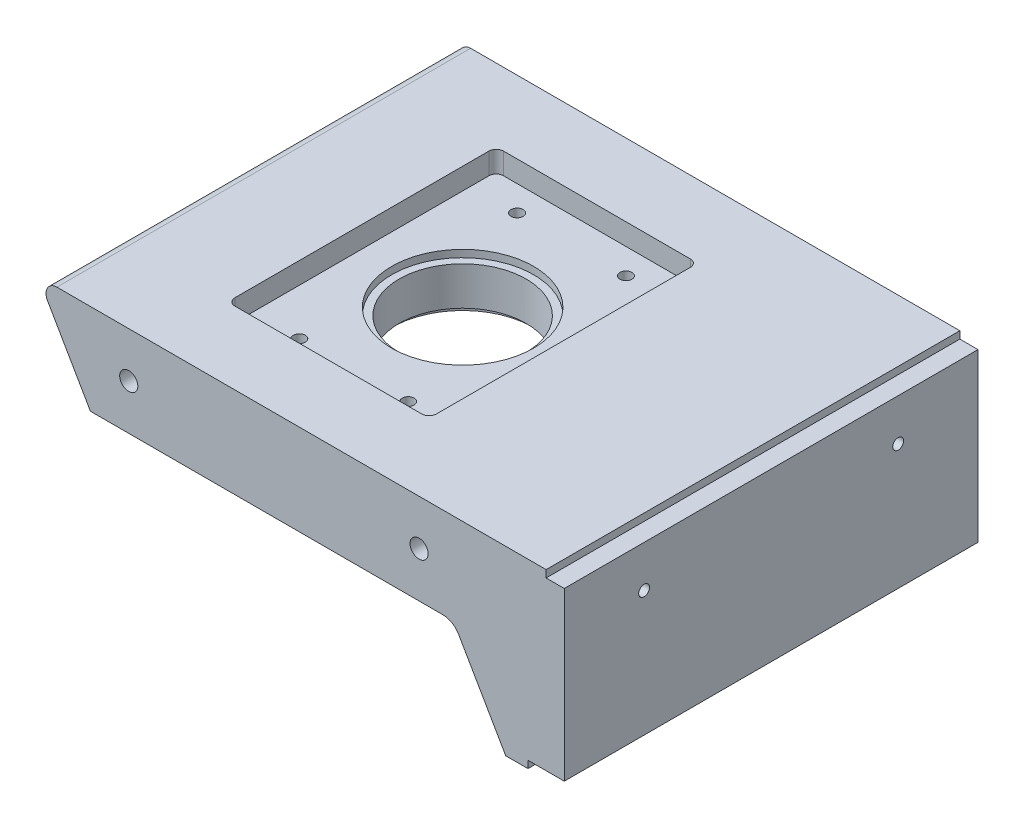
from build123d import *

# Parameters (mm, degrees)
BOSS_EXTRUDE1_DEPTH            = 57
SKETCH5_R                      = 17.5
CUT_EXTRUDE1_DEPTH             = 114.903467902
SKETCH11_W                     = 10
SKETCH11_H                     = 2
CUT_EXTRUDE3_DEPTH             = 148.062061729
M6X1_0_TAPPED_HOLE1_AT_2_COUNT = 2
M6X1_0_TAPPED_HOLE1_AT_2_PITCH = 80
M3X0_5_TAPPED_HOLE2_D          = 2.5
M3X0_5_TAPPED_HOLE2_DEPTH      = 7.5
M3X0_5_TAPPED_HOLE2_TIP        = 0.751075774
FILLET1_R                      = 3
FILLET2_R                      = 5
SKETCH28_W                     = 55.5
SKETCH28_H                     = 74
CUT_EXTRUDE6_DEPTH             = 5.9
SKETCH30_R                     = 19.55
CUT_EXTRUDE8_DEPTH             = 2
FILLET3_R                      = 2
M4X0_7_TAPPED_HOLE1_D          = 3.3
M4X0_7_TAPPED_HOLE1_DEPTH      = 11.5
M4X0_7_TAPPED_HOLE1_TIP        = 0.991420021
SKETCH35_W                     = 55.5
SKETCH35_H                     = 94
CUT_EXTRUDE11_DEPTH            = 4.5
FILLET6_R                      = 2
CUT_EXTRUDE12_START            = -2
SKETCH36_R                     = 19.55
CUT_EXTRUDE12_DEPTH            = 2
M4X0_7_TAPPED_HOLE3_D          = 3.3
M4X0_7_TAPPED_HOLE3_DEPTH      = 11.5
M4X0_7_TAPPED_HOLE3_TIP        = 0.991420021
F_3_0_3_DIAMETER_HOLE2_D       = 3
F_3_0_3_DIAMETER_HOLE2_DEPTH   = 10
F_3_0_3_DIAMETER_HOLE2_TIP     = 0.901290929


with BuildPart() as part:
    # Sketch2 → Boss-Extrude1 (new, symmetric)
    with BuildSketch(Plane.XY):
        Polygon((-60, 12.5), (80, 12.5), (80, 10.5), (85, 10.5), (85, -37.5), (68.87, -37.5), (54.43624327, -12.5), (-45.56624327, -12.5), align=None)
    extrude(amount=BOSS_EXTRUDE1_DEPTH, both=True)

    # Sketch5 → Cut-Extrude1 (cut, through all)
    with BuildSketch(Plane(origin=(0, 12.5, 0), x_dir=(1, 0, 0), z_dir=(0, 1, 0))):
        with Locations(Location((0, 0, 0), (0, 0, 180))):
            Circle(SKETCH5_R)
    extrude(amount=-CUT_EXTRUDE1_DEPTH, mode=Mode.SUBTRACT)

    # Sketch11 → Cut-Extrude3 (cut, through all)
    with BuildSketch(Plane.XY.offset(57)):
        with Locations((80, -36.5)):
            Rectangle(SKETCH11_W, SKETCH11_H)
    extrude(amount=-CUT_EXTRUDE3_DEPTH, mode=Mode.SUBTRACT)

    # Sketch12 → M6x1.0 Tapped Hole1 (revolve, cut)
    with BuildSketch(Plane(origin=(-35, 0, 57), x_dir=(0, -1, 0), z_dir=(1, 0, 0))):
        Polygon((0, 0), (0, 16.502151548), (2.5, 15), (2.5, 0), align=None)
    m6x1_0_tapped_hole1 = revolve(axis=Axis((-35, 0, 63.35), (0, 0, -1)), mode=Mode.SUBTRACT)

    # M6x1.0 Tapped Hole1 at 2: M6x1.0 Tapped Hole1 ×2
    with Locations(*[(i * M6X1_0_TAPPED_HOLE1_AT_2_PITCH, 0, 0) for i in range(1, M6X1_0_TAPPED_HOLE1_AT_2_COUNT)]):
        add(m6x1_0_tapped_hole1, mode=Mode.SUBTRACT)

    # Mirror1: M6x1.0 Tapped Hole1 across plane
    add(m6x1_0_tapped_hole1.mirror(Plane.XY), mode=Mode.SUBTRACT)

    # Mirror1 copy 1 sketch → Mirror1 copy 1 (revolve, cut)
    with BuildSketch(Plane(origin=(45, 0, -57), x_dir=(0, -1, 0), z_dir=(1, 0, 0))):
        Polygon((0, 0), (0, -16.502151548), (2.5, -15), (2.5, 0), align=None)
    revolve(axis=Axis((45, 0, -63.35), (0, 0, -1)), mode=Mode.SUBTRACT)

    # M3x0.5 Tapped Hole2
    with Locations(Plane(origin=(0, -35.5, 0), x_dir=(-1, 0, 0), z_dir=(0, -1, 0))):
        with Locations((-80, -37), (-80, 37)):
            Hole(M3X0_5_TAPPED_HOLE2_D / 2, depth=M3X0_5_TAPPED_HOLE2_DEPTH)
            with Locations((0, 0, -(M3X0_5_TAPPED_HOLE2_DEPTH + M3X0_5_TAPPED_HOLE2_TIP / 2))):  # 118° drill point
                Cone(0, M3X0_5_TAPPED_HOLE2_D / 2, M3X0_5_TAPPED_HOLE2_TIP, mode=Mode.SUBTRACT)

    # Fillet1
    fillet1_edges = [part.edges().sort_by_distance(p)[0] for p in [
        (-60, 12.5, 0),
    ]]
    fillet(fillet1_edges, radius=FILLET1_R)

    # Fillet2
    fillet2_edges = [part.edges().sort_by_distance(p)[0] for p in [
        (54.43624327, -12.5, 0),
    ]]
    fillet(fillet2_edges, radius=FILLET2_R)

    # Sketch28 → Cut-Extrude6 (cut)
    with BuildSketch(Plane(origin=(0, 12.5, 0), x_dir=(1, 0, 0), z_dir=(0, 1, 0))):
        Rectangle(SKETCH28_W, SKETCH28_H)
    extrude(amount=-CUT_EXTRUDE6_DEPTH, mode=Mode.SUBTRACT)

    # Sketch30 → Cut-Extrude8 (cut)
    with BuildSketch(Plane(origin=(0, 6.6, 0), x_dir=(1, 0, 0), z_dir=(0, 1, 0))):
        with Locations(Location((0, 0, 0), (0, 0, 270))):
            Circle(SKETCH30_R)
    extrude(amount=-CUT_EXTRUDE8_DEPTH, mode=Mode.SUBTRACT)

    # Fillet3
    fillet3_edges = [part.edges().sort_by_distance(p)[0] for p in [
        (27.75, 9.55, -37),
        (27.75, 9.55, 37),
        (-27.75, 9.55, 37),
        (-27.75, 9.55, -37),
    ]]
    fillet(fillet3_edges, radius=FILLET3_R)

    # M4x0.7 Tapped Hole1
    with Locations(Plane(origin=(0, 6.6, 0), x_dir=(1, 0, 0), z_dir=(0, 1, 0))):
        with Locations((15, 30), (-15, 30), (-15, -30), (15, -30)):
            Hole(M4X0_7_TAPPED_HOLE1_D / 2, depth=M4X0_7_TAPPED_HOLE1_DEPTH)
            with Locations((0, 0, -(M4X0_7_TAPPED_HOLE1_DEPTH + M4X0_7_TAPPED_HOLE1_TIP / 2))):  # 118° drill point
                Cone(0, M4X0_7_TAPPED_HOLE1_D / 2, M4X0_7_TAPPED_HOLE1_TIP, mode=Mode.SUBTRACT)

    # Sketch35 → Cut-Extrude11 (cut)
    with BuildSketch(Plane.XZ.offset(12.5)):
        Rectangle(SKETCH35_W, SKETCH35_H)
    extrude(amount=-CUT_EXTRUDE11_DEPTH, mode=Mode.SUBTRACT)

    # Fillet6
    fillet6_edges = [part.edges().sort_by_distance(p)[0] for p in [
        (27.75, -10.25, 47),
        (27.75, -10.25, -47),
        (-27.75, -10.25, -47),
        (-27.75, -10.25, 47),
    ]]
    fillet(fillet6_edges, radius=FILLET6_R)

    # Sketch36 → Cut-Extrude12 (cut)
    with BuildSketch(Plane.XZ.offset(8).offset(CUT_EXTRUDE12_START)):
        with Locations(Location((0, 0, 0), (0, 0, 90))):
            Circle(SKETCH36_R)
    extrude(amount=CUT_EXTRUDE12_DEPTH, mode=Mode.SUBTRACT)

    # M4x0.7 Tapped Hole3
    with Locations(Plane(origin=(0, -8, 0), x_dir=(-1, 0, 0), z_dir=(0, -1, 0))):
        with Locations((12.5, 40), (-12.5, 40), (-12.5, -40), (12.5, -40)):
            Hole(M4X0_7_TAPPED_HOLE3_D / 2, depth=M4X0_7_TAPPED_HOLE3_DEPTH)
            with Locations((0, 0, -(M4X0_7_TAPPED_HOLE3_DEPTH + M4X0_7_TAPPED_HOLE3_TIP / 2))):  # 118° drill point
                Cone(0, M4X0_7_TAPPED_HOLE3_D / 2, M4X0_7_TAPPED_HOLE3_TIP, mode=Mode.SUBTRACT)

    # 3.0 _3_ Diameter Hole2
    with Locations(Plane(origin=(85, 0, 0), x_dir=(0, 0, -1), z_dir=(1, 0, 0))):
        with Locations((-35, -1), (35, -1)):
            Hole(F_3_0_3_DIAMETER_HOLE2_D / 2, depth=F_3_0_3_DIAMETER_HOLE2_DEPTH)
            with Locations((0, 0, -(F_3_0_3_DIAMETER_HOLE2_DEPTH + F_3_0_3_DIAMETER_HOLE2_TIP / 2))):  # 118° drill point
                Cone(0, F_3_0_3_DIAMETER_HOLE2_D / 2, F_3_0_3_DIAMETER_HOLE2_TIP, mode=Mode.SUBTRACT)


solid = part.part
